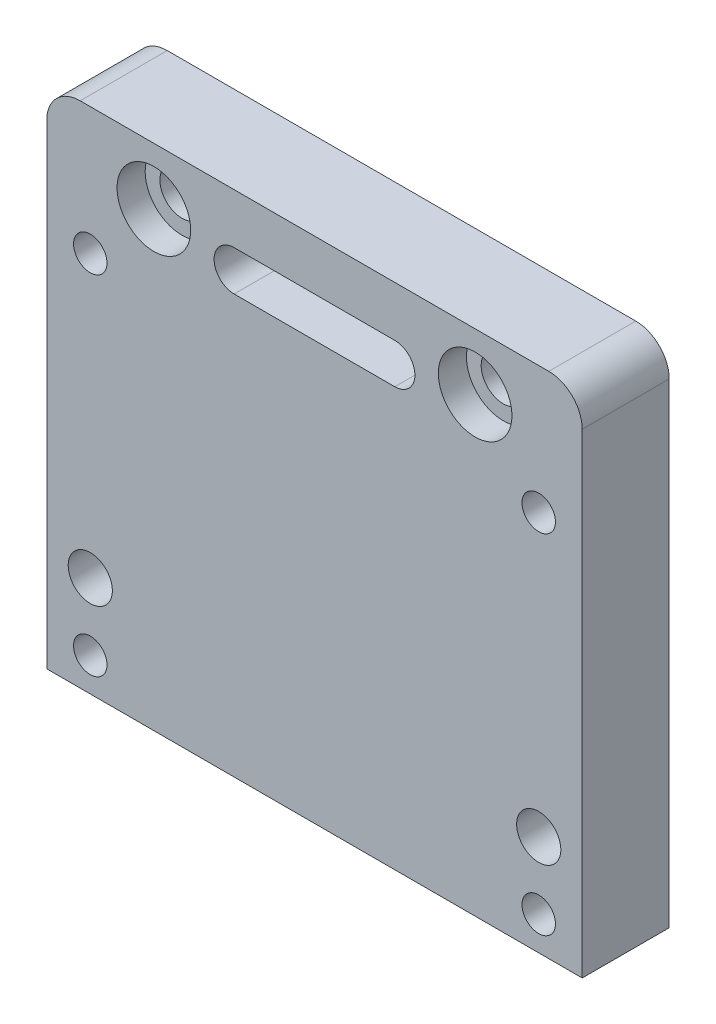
from build123d import *

# Parameters (mm, degrees)
SKIZZE1_W                                            = 80
SKIZZE1_H                                            = 76
LINEAR_AUSTRAGEN1_DEPTH                              = 13
VERRUNDUNG1_R                                        = 5
STIRNSENKUNG_F_R_M6_ZYLINDERSCHRAUBE_MIT_D           = 6.6
STIRNSENKUNG_F_R_M6_ZYLINDERSCHRAUBE_MIT_CBORE_D     = 11
STIRNSENKUNG_F_R_M6_ZYLINDERSCHRAUBE_MIT_CBORE_DEPTH = 4.2
SCHNITT_LINEAR_START                                 = 4.2
SKIZZE12_R                                           = 5.5
SCHNITT_LINEAR_AUSTRAGEN3_DEPTH                      = 4.2
SCHNITT_LINEAR_AUSTRAGEN4_DEPTH                      = 87.861959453
M6_GEWINDEBOHRUNG1_D                                 = 5


with BuildPart() as part:
    # Skizze1 → Linear austragen1 (new body)
    with BuildSketch(Plane.XY):
        with Locations((0, 38)):
            Rectangle(SKIZZE1_W, SKIZZE1_H)
    extrude(amount=LINEAR_AUSTRAGEN1_DEPTH)

    # Verrundung1
    verrundung1_edges = [part.edges().sort_by_distance(p)[0] for p in [
        (-40, 76, 6.5),
        (40, 76, 6.5),
    ]]
    fillet(verrundung1_edges, radius=VERRUNDUNG1_R)

    # Stirnsenkung f_r M6 Zylinderschraube mit (through all)
    with Locations(Plane(origin=(30.287656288, -5.940935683, 0), x_dir=(1, 0, 0), z_dir=(0, 0, -1))):
        with Locations((-54.287656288, -73.440935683), (-6.287656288, -73.440935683), (-63.787656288, -20.940935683), (3.212343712, -20.940935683)):
            CounterBoreHole(STIRNSENKUNG_F_R_M6_ZYLINDERSCHRAUBE_MIT_D / 2, STIRNSENKUNG_F_R_M6_ZYLINDERSCHRAUBE_MIT_CBORE_D / 2, STIRNSENKUNG_F_R_M6_ZYLINDERSCHRAUBE_MIT_CBORE_DEPTH)

    # Skizze12 → Schnitt-Linear austragen3 (cut)
    with BuildSketch(Plane(origin=(0, 0, 13), x_dir=(-1, 0, 0), z_dir=(0, 0, -1)).offset(SCHNITT_LINEAR_START)):
        with Locations((24, 67.5)):
            Circle(SKIZZE12_R)
        with Locations((-24, 67.5)):
            Circle(SKIZZE12_R)
    extrude(amount=-SCHNITT_LINEAR_AUSTRAGEN3_DEPTH, mode=Mode.SUBTRACT)

    # Skizze13 → Schnitt-Linear austragen4 (cut, through all)
    with BuildSketch(Plane.XY.offset(13)):
        with BuildLine():
            Line((-12, 62.5), (12, 62.5))
            ThreePointArc((12, 62.5), (15, 65.5), (12, 68.5))
            Line((12, 68.5), (-12, 68.5))
            ThreePointArc((-12, 68.5), (-15, 65.5), (-12, 62.5))
        make_face()
    extrude(amount=-SCHNITT_LINEAR_AUSTRAGEN4_DEPTH, mode=Mode.SUBTRACT)

    # M6 Gewindebohrung1 (through all)
    with Locations(Plane.XY.offset(13)):
        with Locations((-33.5, 57), (-33.5, 5), (33.5, 5), (33.5, 57)):
            Hole(M6_GEWINDEBOHRUNG1_D / 2)


solid = part.part
